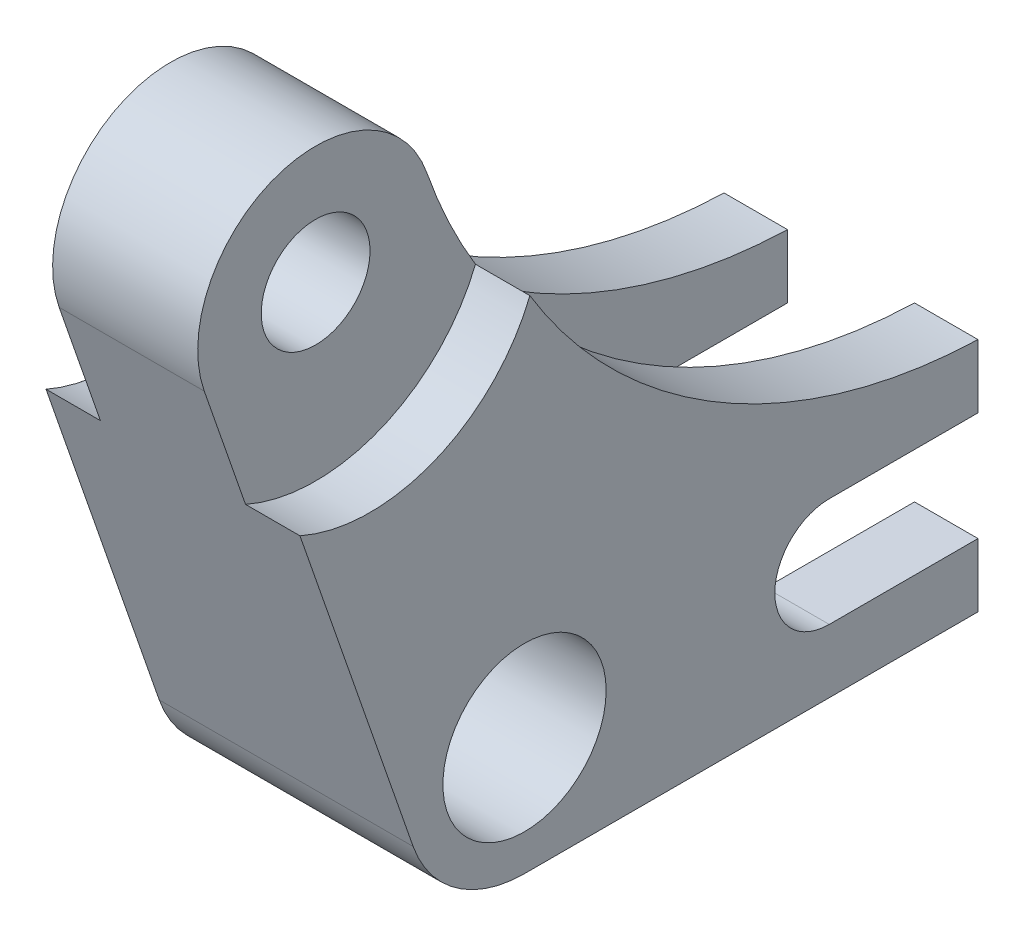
from build123d import *

# Parameters (mm, degrees)
ESBO_O1_R                  = 6
ESBO_O1_R_2                = 9
RESSALTO_EXTRUS_O1_DEPTH   = 28
CORTE_EXTRUS_O1_DEPTH      = 85.427483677
CORTE_EXTRUS_O3_DEPTH      = 85.427483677
CORTE_EXTRUS_O3_DEPTH_BACK = 85.427483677
ESBO_O3_W                  = 14
ESBO_O3_H                  = 38
CORTE_EXTRUS_O4_DEPTH      = 6
CORTE_EXTRUS_O5_START      = 22
CORTE_EXTRUS_O5_DEPTH      = 6


with BuildPart() as part:
    # Esbo_o1 → Ressalto-extrus_o1 (new body)
    with BuildSketch(Plane(origin=(0, 0, 0), x_dir=(0, 0, -1), z_dir=(1, 0, 0))):
        with BuildLine():
            Line((0, -13), (50, -13))
            Line((50, -13), (50, 13))
            ThreePointArc((50, 13), (16.371248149, 24.633658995), (-4.754106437, 53.26850431))
            ThreePointArc((-4.754106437, 53.26850431), (-21.301856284, 61.279245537), (-29.312597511, 44.73149569))
            Line((-29.312597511, 44.73149569), (-12.279245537, -4.26850431))
            ThreePointArc((-12.279245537, -4.26850431), (-7.533572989, -10.594587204), (0, -13))
        make_face()
        with Locations((-17.033351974, 49)):
            Circle(ESBO_O1_R, mode=Mode.SUBTRACT)
        Circle(ESBO_O1_R_2, mode=Mode.SUBTRACT)
    extrude(amount=RESSALTO_EXTRUS_O1_DEPTH)

    # Esbo_o2 → Corte-extrus_o1 (cut, through all)
    with BuildSketch(Plane(origin=(0, 0, 0), x_dir=(0, 0, -1), z_dir=(1, 0, 0))):
        with BuildLine():
            Line((50, -6), (33.599578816, -6))
            ThreePointArc((33.599578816, -6), (27.599578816, 0), (33.599578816, 6))
            Line((33.599578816, 6), (50, 6))
            ThreePointArc((50, 6), (56, 0), (50, -6))
        make_face()
    extrude(amount=CORTE_EXTRUS_O1_DEPTH, mode=Mode.SUBTRACT)

    # Esbo_o3 → Corte-extrus_o3 (cut, two sides: drawn at the far end of the back side and taken through both)
    with BuildSketch(Plane(origin=(0, 0, 0), x_dir=(1, 0, 0), z_dir=(0, 1, 0)).offset(-CORTE_EXTRUS_O3_DEPTH_BACK)):
        with Locations((14, 31)):
            Rectangle(ESBO_O3_W, ESBO_O3_H)
    extrude(amount=CORTE_EXTRUS_O3_DEPTH + CORTE_EXTRUS_O3_DEPTH_BACK, mode=Mode.SUBTRACT)

    # Esbo_o4 → Corte-extrus_o4 (cut)
    with BuildSketch(Plane(origin=(0, 0, 0), x_dir=(0, 0, -1), z_dir=(1, 0, 0))):
        with BuildLine():
            Line((-34.979941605, 42.761416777), (-39.248445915, 55.040662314))
            ThreePointArc((-39.248445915, 55.040662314), (-27.540439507, 79.225835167), (-3.355266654, 67.51782876))
            Line((-3.355266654, 67.51782876), (0.913237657, 55.238583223))
            ThreePointArc((0.913237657, 55.238583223), (-10.794768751, 31.053410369), (-34.979941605, 42.761416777))
        make_face()
    extrude(amount=CORTE_EXTRUS_O4_DEPTH, mode=Mode.SUBTRACT)

    # Esbo_o4_2 → Corte-extrus_o5 (cut)
    with BuildSketch(Plane(origin=(0, 0, 0), x_dir=(0, 0, -1), z_dir=(1, 0, 0)).offset(CORTE_EXTRUS_O5_START)):
        with BuildLine():
            Line((-34.979941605, 42.761416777), (-39.248445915, 55.040662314))
            ThreePointArc((-39.248445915, 55.040662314), (-27.540439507, 79.225835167), (-3.355266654, 67.51782876))
            Line((-3.355266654, 67.51782876), (0.913237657, 55.238583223))
            ThreePointArc((0.913237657, 55.238583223), (-10.794768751, 31.053410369), (-34.979941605, 42.761416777))
        make_face()
    extrude(amount=CORTE_EXTRUS_O5_DEPTH, mode=Mode.SUBTRACT)


solid = part.part
